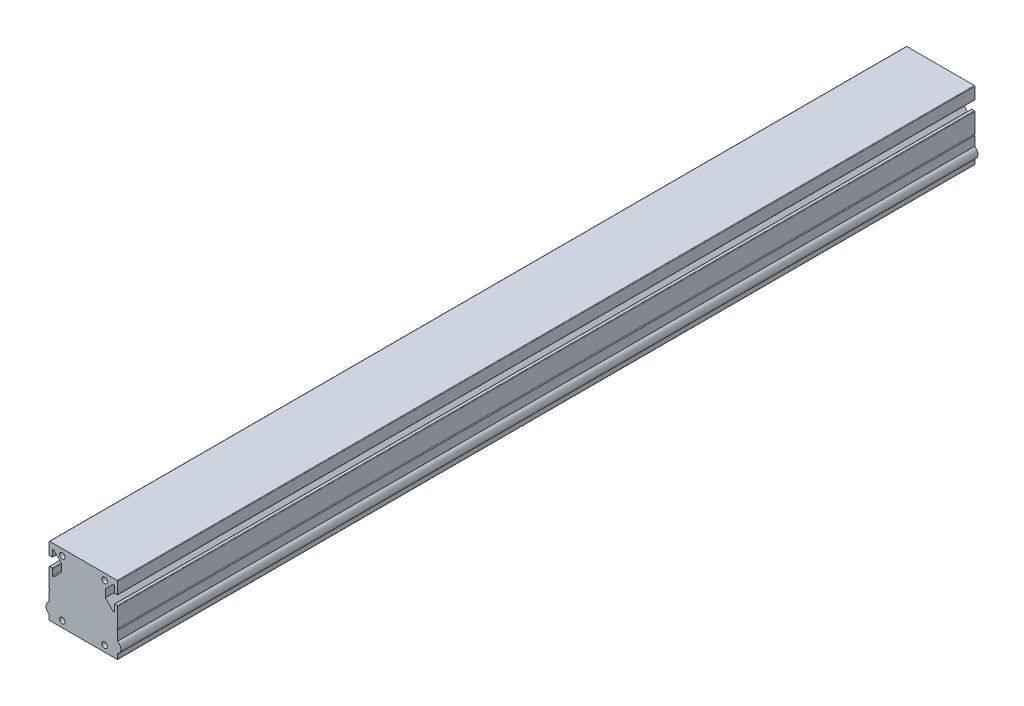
from build123d import *

# Parameters (mm, degrees)
AUSSEN_W                         = 60
AUSSEN_H                         = 60
LINEAR_AUSTRAGEN1_DEPTH          = 750
SCHNITT_LINEAR_AUSTRAGEN2_DEPTH  = 752.199041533
SCHNITT_LINEAR_AUSTRAGEN3_DEPTH  = 752.199041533
SCHNITT_LINEAR_AUSTRAGEN4_DEPTH  = 752.199041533
VERRUNDUNG1_R                    = 0.5
VERRUNDUNG2_R                    = 0.3
F_4_9_4_9_DURCHMESSER_BOHRUNG1_D = 4.9
LINEAR_START                     = -750
SKIZZE9_R                        = 5.05
LINEAR_AUSTRAGEN2_DEPTH          = 750


with BuildPart() as part:
    # Aussen → Linear austragen1 (new body)
    with BuildSketch(Plane.XY):
        Rectangle(AUSSEN_W, AUSSEN_H)
    extrude(amount=LINEAR_AUSTRAGEN1_DEPTH)

    # Markierung → Schnitt-Linear austragen2 (cut, through all)
    with BuildSketch(Plane.XY):
        with BuildLine():
            Line((30, -7.6), (30, -6.4))
            ThreePointArc((30, -6.4), (29.4, -7), (30, -7.6))
        make_face()
    schnitt_linear_austragen2 = extrude(amount=SCHNITT_LINEAR_AUSTRAGEN2_DEPTH, mode=Mode.SUBTRACT)

    # F_hrung → Schnitt-Linear austragen3 (cut, through all)
    with BuildSketch(Plane.XY):
        with BuildLine():
            Line((30, -25.195831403), (30, -16.204168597))
            ThreePointArc((30, -16.204168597), (22.65, -20.7), (30, -25.195831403))
        make_face()
    schnitt_linear_austragen3 = extrude(amount=SCHNITT_LINEAR_AUSTRAGEN3_DEPTH, mode=Mode.SUBTRACT)

    # NUT → Schnitt-Linear austragen4 (cut, through all)
    with BuildSketch(Plane.XY):
        Polygon((30, 10.95), (30, 19.05), (27, 19.05), (27, 26.207106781), (19.2, 18.407106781), (19.2, 11.592893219), (27, 3.792893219), (27, 10.95), align=None)
    schnitt_linear_austragen4 = extrude(amount=SCHNITT_LINEAR_AUSTRAGEN4_DEPTH, mode=Mode.SUBTRACT)

    # Spiegeln2: Schnitt-Linear austragen2, Schnitt-Linear austragen3, Schnitt-Linear austragen4 across plane
    add(schnitt_linear_austragen2.mirror(Plane(origin=(0, 0, 0), x_dir=(0, 0, 1), z_dir=(1, 0, 0))), mode=Mode.SUBTRACT)
    add(schnitt_linear_austragen3.mirror(Plane(origin=(0, 0, 0), x_dir=(0, 0, 1), z_dir=(1, 0, 0))), mode=Mode.SUBTRACT)
    add(schnitt_linear_austragen4.mirror(Plane(origin=(0, 0, 0), x_dir=(0, 0, 1), z_dir=(1, 0, 0))), mode=Mode.SUBTRACT)

    # Verrundung1
    verrundung1_edges = [part.edges().sort_by_distance(p)[0] for p in [
        (27, 10.95, 375),
        (30, 10.95, 375),
        (30, 19.05, 375),
        (27, 19.05, 375),
        (27, 26.207106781, 375),
        (27, 3.792893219, 375),
        (-30, -30, 375),
        (-30, 30, 375),
        (30, 30, 375),
        (30, -30, 375),
        (-30, 10.95, 375),
        (-27, 10.95, 375),
        (-27, 3.792893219, 375),
        (-27, 26.207106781, 375),
        (-27, 19.05, 375),
        (-30, 19.05, 375),
    ]]
    fillet(verrundung1_edges, radius=VERRUNDUNG1_R)

    # Verrundung2
    verrundung2_edges = [part.edges().sort_by_distance(p)[0] for p in [
        (30, -16.204168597, 375),
        (30, -25.195831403, 375),
        (-30, -25.195831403, 375),
        (-30, -16.204168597, 375),
    ]]
    fillet(verrundung2_edges, radius=VERRUNDUNG2_R)

    # 4.9 _4.9_ Durchmesser Bohrung1 (through all)
    with Locations(Plane(origin=(0, 0, 0), x_dir=(-1, 0, 0), z_dir=(0, 0, -1))):
        with Locations((-18.5, 24.5), (18.5, 24.5), (-18.5, -24.5), (18.5, -24.5)):
            Hole(F_4_9_4_9_DURCHMESSER_BOHRUNG1_D / 2)

    # Skizze9 → Linear austragen2 (add)
    with BuildSketch(Plane.XY.offset(750).offset(LINEAR_START)):
        with Locations((-27.7, -20.7)):
            Circle(SKIZZE9_R)
        with Locations((27.7, -20.7)):
            Circle(SKIZZE9_R)
    extrude(amount=LINEAR_AUSTRAGEN2_DEPTH)


solid = part.part
